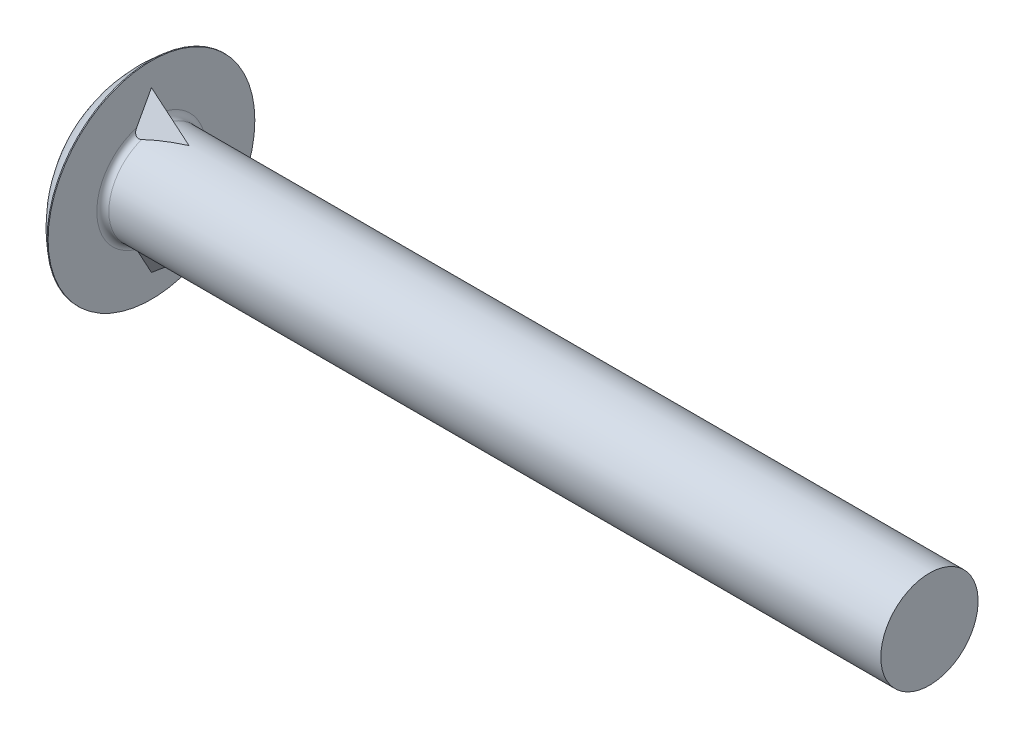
ISO-10303-21;
HEADER;
FILE_DESCRIPTION(('STEP AP214'),'2;1');
FILE_NAME('part.step','',(''),(''),'','','');
FILE_SCHEMA(('AUTOMOTIVE_DESIGN { 1 0 10303 214 1 1 1 1 }'));
ENDSEC;
DATA;
#1=APPLICATION_CONTEXT('core data for automotive mechanical design processes');
#2=APPLICATION_PROTOCOL_DEFINITION('international standard','automotive_design',2000,#1);
#3=PRODUCT_CONTEXT('',#1,'mechanical');
#4=PRODUCT('Part','Part','',(#3));
#5=PRODUCT_RELATED_PRODUCT_CATEGORY('part','',(#4));
#6=PRODUCT_DEFINITION_FORMATION('','',#4);
#7=PRODUCT_DEFINITION_CONTEXT('part definition',#1,'design');
#8=PRODUCT_DEFINITION('design','',#6,#7);
#9=PRODUCT_DEFINITION_SHAPE('','',#8);
#10=(LENGTH_UNIT() NAMED_UNIT(*) SI_UNIT(.MILLI.,.METRE.));
#11=(NAMED_UNIT(*) PLANE_ANGLE_UNIT() SI_UNIT($,.RADIAN.));
#12=(NAMED_UNIT(*) SI_UNIT($,.STERADIAN.) SOLID_ANGLE_UNIT());
#13=UNCERTAINTY_MEASURE_WITH_UNIT(LENGTH_MEASURE(1.E-05),#10,'distance_accuracy_value','');
#14=(GEOMETRIC_REPRESENTATION_CONTEXT(3) GLOBAL_UNCERTAINTY_ASSIGNED_CONTEXT((#13)) GLOBAL_UNIT_ASSIGNED_CONTEXT((#10,
#11,#12)) REPRESENTATION_CONTEXT('',''));
#15=CARTESIAN_POINT('',(0.,0.,0.));
#16=DIRECTION('',(0.,0.,1.));
#17=DIRECTION('',(1.,0.,0.));
#18=AXIS2_PLACEMENT_3D('',#15,#16,#17);
#19=CARTESIAN_POINT('',(0.,0.,0.));
#20=DIRECTION('',(-1.,0.,0.));
#21=DIRECTION('',(0.,0.,1.));
#22=AXIS2_PLACEMENT_3D('',#19,#20,#21);
#23=CYLINDRICAL_SURFACE('',#22,6.35);
#24=CARTESIAN_POINT('',(108.204,0.,0.));
#25=DIRECTION('',(-1.,0.,0.));
#26=DIRECTION('',(0.,0.,1.));
#27=AXIS2_PLACEMENT_3D('',#24,#25,#26);
#28=CIRCLE('',#27,6.35);
#29=CARTESIAN_POINT('',(108.204,0.,6.35));
#30=VERTEX_POINT('',#29);
#31=EDGE_CURVE('E162',#30,#30,#28,.T.);
#32=ORIENTED_EDGE('',*,*,#31,.T.);
#33=EDGE_LOOP('',(#32));
#34=FACE_BOUND('',#33,.T.);
#35=CARTESIAN_POINT('',(7.3914,0.,0.));
#36=DIRECTION('',(-1.,0.,0.));
#37=DIRECTION('',(0.,0.,1.));
#38=AXIS2_PLACEMENT_3D('',#35,#36,#37);
#39=CIRCLE('',#38,6.35);
#40=CARTESIAN_POINT('',(7.3914,-6.00637071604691,2.0605850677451));
#41=VERTEX_POINT('',#40);
#42=CARTESIAN_POINT('',(7.3914,6.0063707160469,2.06058506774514));
#43=VERTEX_POINT('',#42);
#44=EDGE_CURVE('E105',#41,#43,#39,.T.);
#45=ORIENTED_EDGE('',*,*,#44,.F.);
#46=CARTESIAN_POINT('',(19.0947448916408,0.,0.));
#47=DIRECTION('',(-0.371354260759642,0.443785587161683,-0.815567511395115));
#48=DIRECTION('',(-0.928491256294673,-0.177494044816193,0.326189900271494));
#49=AXIS2_PLACEMENT_3D('',#46,#47,#48);
#50=ELLIPSE('',#49,17.0995749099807,6.35);
#51=CARTESIAN_POINT('',(11.5062,-6.34999999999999,0.));
#52=VERTEX_POINT('',#51);
#53=EDGE_CURVE('E98',#41,#52,#50,.F.);
#54=ORIENTED_EDGE('',*,*,#53,.T.);
#55=CARTESIAN_POINT('',(19.0947448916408,0.,0.));
#56=DIRECTION('',(-0.371354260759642,0.443785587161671,0.815567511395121));
#57=DIRECTION('',(-0.928491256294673,-0.177494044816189,-0.326189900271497));
#58=AXIS2_PLACEMENT_3D('',#55,#56,#57);
#59=ELLIPSE('',#58,17.0995749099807,6.35);
#60=CARTESIAN_POINT('',(7.3914,-6.00637071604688,-2.06058506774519));
#61=VERTEX_POINT('',#60);
#62=EDGE_CURVE('E86',#52,#61,#59,.F.);
#63=ORIENTED_EDGE('',*,*,#62,.T.);
#64=CARTESIAN_POINT('',(7.3914,6.0063707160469,-2.06058506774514));
#65=VERTEX_POINT('',#64);
#66=EDGE_CURVE('E160',#65,#61,#39,.T.);
#67=ORIENTED_EDGE('',*,*,#66,.F.);
#68=CARTESIAN_POINT('',(19.0947448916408,0.,0.));
#69=DIRECTION('',(-0.371354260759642,-0.443785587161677,0.815567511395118));
#70=DIRECTION('',(-0.928491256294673,0.177494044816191,-0.326189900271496));
#71=AXIS2_PLACEMENT_3D('',#68,#69,#70);
#72=ELLIPSE('',#71,17.0995749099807,6.35);
#73=CARTESIAN_POINT('',(11.5062,6.34999999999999,0.));
#74=VERTEX_POINT('',#73);
#75=EDGE_CURVE('E147',#65,#74,#72,.F.);
#76=ORIENTED_EDGE('',*,*,#75,.T.);
#77=CARTESIAN_POINT('',(19.0947448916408,0.,0.));
#78=DIRECTION('',(-0.371354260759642,-0.443785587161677,-0.815567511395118));
#79=DIRECTION('',(-0.928491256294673,0.177494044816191,0.326189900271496));
#80=AXIS2_PLACEMENT_3D('',#77,#78,#79);
#81=ELLIPSE('',#80,17.0995749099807,6.35);
#82=EDGE_CURVE('E124',#74,#43,#81,.F.);
#83=ORIENTED_EDGE('',*,*,#82,.T.);
#84=EDGE_LOOP('',(#45,#54,#63,#67,#76,#83));
#85=FACE_BOUND('',#84,.T.);
#86=ADVANCED_FACE('F34',(#34,#85),#23,.T.);
#87=CARTESIAN_POINT('',(7.3914,0.,0.));
#88=DIRECTION('',(-1.,0.,0.));
#89=DIRECTION('',(0.,0.,1.));
#90=AXIS2_PLACEMENT_3D('',#87,#88,#89);
#91=TOROIDAL_SURFACE('',#90,7.1374,0.7874);
#92=CARTESIAN_POINT('',(7.3916,-6.00640916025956,2.06047308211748));
#93=CARTESIAN_POINT('',(7.36372668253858,-6.00103846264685,2.07608713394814));
#94=CARTESIAN_POINT('',(7.3350661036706,-5.99737529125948,2.09113051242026));
#95=CARTESIAN_POINT('',(7.27637319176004,-5.99418017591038,2.11959389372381));
#96=CARTESIAN_POINT('',(7.24632961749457,-5.99469200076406,2.1329951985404));
#97=CARTESIAN_POINT('',(7.1854538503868,-6.00072971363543,2.15742852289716));
#98=CARTESIAN_POINT('',(7.15461744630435,-6.00629297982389,2.16844212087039));
#99=CARTESIAN_POINT('',(7.09357934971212,-6.02295346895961,2.18716904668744));
#100=CARTESIAN_POINT('',(7.06337523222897,-6.03402249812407,2.19489882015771));
#101=CARTESIAN_POINT('',(7.00809759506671,-6.05995236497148,2.20595895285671));
#102=CARTESIAN_POINT('',(6.98283199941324,-6.07423608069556,2.20969080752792));
#103=CARTESIAN_POINT('',(6.93443573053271,-6.10647600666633,2.21418405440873));
#104=CARTESIAN_POINT('',(6.91130823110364,-6.12443755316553,2.21494109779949));
#105=CARTESIAN_POINT('',(6.86864109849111,-6.16239355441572,2.21371531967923));
#106=CARTESIAN_POINT('',(6.84899078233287,-6.18226922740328,2.21184753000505));
#107=CARTESIAN_POINT('',(6.81226461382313,-6.2239376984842,2.20589652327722));
#108=CARTESIAN_POINT('',(6.7951888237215,-6.24573054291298,2.20181325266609));
#109=CARTESIAN_POINT('',(6.75403898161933,-6.30417841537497,2.1887460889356));
#110=CARTESIAN_POINT('',(6.73193069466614,-6.34189072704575,2.17829180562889));
#111=CARTESIAN_POINT('',(6.69355369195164,-6.4190852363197,2.15376122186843));
#112=CARTESIAN_POINT('',(6.67730231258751,-6.45857230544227,2.13967437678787));
#113=CARTESIAN_POINT('',(6.64361793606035,-6.55681832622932,2.10155204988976));
#114=CARTESIAN_POINT('',(6.62916403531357,-6.61598231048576,2.07593969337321));
#115=CARTESIAN_POINT('',(6.60974716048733,-6.73394025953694,2.02059479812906));
#116=CARTESIAN_POINT('',(6.60480315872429,-6.79273325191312,1.99085414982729));
#117=CARTESIAN_POINT('',(6.6034817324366,-6.90020760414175,1.93297439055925));
#118=CARTESIAN_POINT('',(6.60595018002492,-6.94910322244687,1.9052442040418));
#119=CARTESIAN_POINT('',(6.61663481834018,-7.04488403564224,1.84826065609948));
#120=CARTESIAN_POINT('',(6.62480978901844,-7.091781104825,1.81901960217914));
#121=CARTESIAN_POINT('',(6.63565687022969,-7.1376,1.7891485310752));
#122=B_SPLINE_CURVE_WITH_KNOTS('',3,(#92,#93,#94,#95,#96,#97,#98,#99,#100,#101,#102,#103,#104,
#105,#106,#107,#108,#109,#110,#111,#112,#113,#114,#115,#116,#117,#118,#119,#120,#121),
.UNSPECIFIED.,.F.,.F.,(4,2,2,2,2,2,2,2,2,2,2,2,2,2,4),(0.,0.0973157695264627,0.195653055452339,
0.294723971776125,0.393292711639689,0.480608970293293,0.568052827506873,0.65178179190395,
0.735512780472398,0.869590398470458,1.00406168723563,1.20120281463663,1.3987368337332,
1.56718680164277,1.73443242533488),.UNSPECIFIED.);
#123=CARTESIAN_POINT('',(6.604,-6.86537516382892,1.95169224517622));
#124=VERTEX_POINT('',#123);
#125=EDGE_CURVE('E94',#41,#124,#122,.T.);
#126=ORIENTED_EDGE('',*,*,#125,.F.);
#127=ORIENTED_EDGE('',*,*,#44,.T.);
#128=CARTESIAN_POINT('',(6.63565687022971,7.1376,1.78914853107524));
#129=CARTESIAN_POINT('',(6.62756575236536,7.10347197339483,1.81140321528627));
#130=CARTESIAN_POINT('',(6.62097048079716,7.06874756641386,1.83330130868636));
#131=CARTESIAN_POINT('',(6.61089030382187,6.99825561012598,1.87624886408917));
#132=CARTESIAN_POINT('',(6.60741067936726,6.96248639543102,1.89729682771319));
#133=CARTESIAN_POINT('',(6.60368804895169,6.88976758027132,1.93856131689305));
#134=CARTESIAN_POINT('',(6.60348161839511,6.85280925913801,1.95876593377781));
#135=CARTESIAN_POINT('',(6.60660270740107,6.77837845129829,1.99784582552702));
#136=CARTESIAN_POINT('',(6.60992731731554,6.74090641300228,2.01672218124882));
#137=CARTESIAN_POINT('',(6.62183800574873,6.65522176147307,2.05792358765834));
#138=CARTESIAN_POINT('',(6.63163148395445,6.60692415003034,2.07974512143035));
#139=CARTESIAN_POINT('',(6.65822425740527,6.51091278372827,2.11988051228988));
#140=CARTESIAN_POINT('',(6.67499908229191,6.46319758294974,2.13820629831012));
#141=CARTESIAN_POINT('',(6.71090031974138,6.38257070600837,2.16573187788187));
#142=CARTESIAN_POINT('',(6.72811144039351,6.34919653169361,2.17605543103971));
#143=CARTESIAN_POINT('',(6.76724047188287,6.28439640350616,2.19349927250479));
#144=CARTESIAN_POINT('',(6.78915208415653,6.2529679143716,2.20062380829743));
#145=CARTESIAN_POINT('',(6.83250691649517,6.20006860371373,2.20966775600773));
#146=CARTESIAN_POINT('',(6.85297009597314,6.17793788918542,2.21239248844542));
#147=CARTESIAN_POINT('',(6.89679144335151,6.13654715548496,2.21496170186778));
#148=CARTESIAN_POINT('',(6.9201470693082,6.11728464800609,2.21480869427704));
#149=CARTESIAN_POINT('',(6.96948106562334,6.08240020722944,2.21132746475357));
#150=CARTESIAN_POINT('',(6.9954757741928,6.06680321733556,2.20797823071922));
#151=CARTESIAN_POINT('',(7.04910342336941,6.04012179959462,2.19807834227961));
#152=CARTESIAN_POINT('',(7.07673546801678,6.02903492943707,2.19152942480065));
#153=CARTESIAN_POINT('',(7.12993706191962,6.01240908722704,2.17635185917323));
#154=CARTESIAN_POINT('',(7.15544993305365,6.00643967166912,2.16798324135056));
#155=CARTESIAN_POINT('',(7.20639602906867,5.99813645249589,2.14930397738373));
#156=CARTESIAN_POINT('',(7.23182899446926,5.99580990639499,2.13898950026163));
#157=CARTESIAN_POINT('',(7.28010434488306,5.9944757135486,2.11773416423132));
#158=CARTESIAN_POINT('',(7.30299268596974,5.99522045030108,2.10690711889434));
#159=CARTESIAN_POINT('',(7.34793115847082,5.99911561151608,2.08432565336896));
#160=CARTESIAN_POINT('',(7.36998550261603,6.00225154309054,2.07257720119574));
#161=CARTESIAN_POINT('',(7.3916,6.00640916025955,2.06047308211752));
#162=B_SPLINE_CURVE_WITH_KNOTS('',3,(#128,#129,#130,#131,#132,#133,#134,#135,#136,#137,#138,
#139,#140,#141,#142,#143,#144,#145,#146,#147,#148,#149,#150,#151,#152,#153,#154,#155,#156,#157,
#158,#159,#160,#161),.UNSPECIFIED.,.F.,.F.,(4,2,2,2,2,2,2,2,2,2,2,2,2,2,2,2,4),(0.,
0.12459416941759,0.249399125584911,0.375597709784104,0.501692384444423,0.662902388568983,
0.823552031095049,0.940022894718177,1.05633865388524,1.14678047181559,1.23714336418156,
1.32810442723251,1.41901616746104,1.50119979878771,1.58354695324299,1.65939026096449,
1.73477750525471),.UNSPECIFIED.);
#163=CARTESIAN_POINT('',(6.604,6.86537516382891,1.95169224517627));
#164=VERTEX_POINT('',#163);
#165=EDGE_CURVE('E117',#164,#43,#162,.T.);
#166=ORIENTED_EDGE('',*,*,#165,.F.);
#167=CARTESIAN_POINT('',(6.604,0.,0.));
#168=DIRECTION('',(-1.,0.,0.));
#169=DIRECTION('',(0.,0.,1.));
#170=AXIS2_PLACEMENT_3D('',#167,#168,#169);
#171=CIRCLE('',#170,7.1374);
#172=EDGE_CURVE('E156',#124,#164,#171,.T.);
#173=ORIENTED_EDGE('',*,*,#172,.F.);
#174=EDGE_LOOP('',(#126,#127,#166,#173));
#175=FACE_BOUND('',#174,.T.);
#176=ADVANCED_FACE('F126',(#175),#91,.F.);
#177=CARTESIAN_POINT('',(6.63565687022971,-7.1376,-1.78914853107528));
#178=CARTESIAN_POINT('',(6.62756575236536,-7.10347197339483,-1.81140321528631));
#179=CARTESIAN_POINT('',(6.62097048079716,-7.06874756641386,-1.8333013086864));
#180=CARTESIAN_POINT('',(6.61089030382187,-6.99825561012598,-1.87624886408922));
#181=CARTESIAN_POINT('',(6.60741067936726,-6.96248639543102,-1.89729682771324));
#182=CARTESIAN_POINT('',(6.60368804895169,-6.88976758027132,-1.93856131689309));
#183=CARTESIAN_POINT('',(6.60348161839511,-6.852809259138,-1.95876593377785));
#184=CARTESIAN_POINT('',(6.60660270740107,-6.77837845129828,-1.99784582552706));
#185=CARTESIAN_POINT('',(6.60992731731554,-6.74090641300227,-2.01672218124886));
#186=CARTESIAN_POINT('',(6.62183800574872,-6.65522176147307,-2.05792358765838));
#187=CARTESIAN_POINT('',(6.63163148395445,-6.60692415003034,-2.07974512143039));
#188=CARTESIAN_POINT('',(6.65822425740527,-6.51091278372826,-2.11988051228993));
#189=CARTESIAN_POINT('',(6.67499908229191,-6.46319758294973,-2.13820629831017));
#190=CARTESIAN_POINT('',(6.71090031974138,-6.38257070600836,-2.16573187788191));
#191=CARTESIAN_POINT('',(6.72811144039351,-6.3491965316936,-2.17605543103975));
#192=CARTESIAN_POINT('',(6.76724047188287,-6.28439640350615,-2.19349927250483));
#193=CARTESIAN_POINT('',(6.78915208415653,-6.25296791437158,-2.20062380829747));
#194=CARTESIAN_POINT('',(6.83250691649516,-6.20006860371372,-2.20966775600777));
#195=CARTESIAN_POINT('',(6.85297009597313,-6.17793788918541,-2.21239248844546));
#196=CARTESIAN_POINT('',(6.89679144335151,-6.13654715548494,-2.21496170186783));
#197=CARTESIAN_POINT('',(6.92014706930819,-6.11728464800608,-2.21480869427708));
#198=CARTESIAN_POINT('',(6.96948106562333,-6.08240020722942,-2.21132746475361));
#199=CARTESIAN_POINT('',(6.9954757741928,-6.06680321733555,-2.20797823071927));
#200=CARTESIAN_POINT('',(7.0491034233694,-6.0401217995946,-2.19807834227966));
#201=CARTESIAN_POINT('',(7.07673546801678,-6.02903492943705,-2.19152942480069));
#202=CARTESIAN_POINT('',(7.12993706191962,-6.01240908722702,-2.17635185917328));
#203=CARTESIAN_POINT('',(7.15544993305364,-6.0064396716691,-2.16798324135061));
#204=CARTESIAN_POINT('',(7.20639602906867,-5.99813645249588,-2.14930397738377));
#205=CARTESIAN_POINT('',(7.23182899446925,-5.99580990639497,-2.13898950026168));
#206=CARTESIAN_POINT('',(7.28010434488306,-5.99447571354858,-2.11773416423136));
#207=CARTESIAN_POINT('',(7.30299268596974,-5.99522045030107,-2.10690711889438));
#208=CARTESIAN_POINT('',(7.34793115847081,-5.99911561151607,-2.084325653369));
#209=CARTESIAN_POINT('',(7.36998550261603,-6.00225154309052,-2.07257720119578));
#210=CARTESIAN_POINT('',(7.3916,-6.00640916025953,-2.06047308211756));
#211=B_SPLINE_CURVE_WITH_KNOTS('',3,(#177,#178,#179,#180,#181,#182,#183,#184,#185,#186,#187,
#188,#189,#190,#191,#192,#193,#194,#195,#196,#197,#198,#199,#200,#201,#202,#203,#204,#205,#206,
#207,#208,#209,#210),.UNSPECIFIED.,.F.,.F.,(4,2,2,2,2,2,2,2,2,2,2,2,2,2,2,2,4),(0.,
0.124594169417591,0.249399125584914,0.375597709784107,0.501692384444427,0.66290238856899,
0.823552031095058,0.940022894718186,1.05633865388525,1.1467804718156,1.23714336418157,
1.32810442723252,1.41901616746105,1.50119979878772,1.583546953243,1.6593902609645,
1.73477750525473),.UNSPECIFIED.);
#212=CARTESIAN_POINT('',(6.604,-6.8653751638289,-1.95169224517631));
#213=VERTEX_POINT('',#212);
#214=EDGE_CURVE('E89',#213,#61,#211,.T.);
#215=ORIENTED_EDGE('',*,*,#214,.F.);
#216=CARTESIAN_POINT('',(6.604,6.86537516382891,-1.95169224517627));
#217=VERTEX_POINT('',#216);
#218=EDGE_CURVE('E157',#217,#213,#171,.T.);
#219=ORIENTED_EDGE('',*,*,#218,.F.);
#220=CARTESIAN_POINT('',(7.3916,6.00640916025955,-2.06047308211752));
#221=CARTESIAN_POINT('',(7.36372668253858,6.00103846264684,-2.07608713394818));
#222=CARTESIAN_POINT('',(7.3350661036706,5.99737529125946,-2.0911305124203));
#223=CARTESIAN_POINT('',(7.27637319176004,5.99418017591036,-2.11959389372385));
#224=CARTESIAN_POINT('',(7.24632961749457,5.99469200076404,-2.13299519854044));
#225=CARTESIAN_POINT('',(7.18545385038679,6.00072971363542,-2.1574285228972));
#226=CARTESIAN_POINT('',(7.15461744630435,6.00629297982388,-2.16844212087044));
#227=CARTESIAN_POINT('',(7.09357934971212,6.02295346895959,-2.18716904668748));
#228=CARTESIAN_POINT('',(7.06337523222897,6.03402249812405,-2.19489882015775));
#229=CARTESIAN_POINT('',(7.00809759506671,6.05995236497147,-2.20595895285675));
#230=CARTESIAN_POINT('',(6.98283199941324,6.07423608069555,-2.20969080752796));
#231=CARTESIAN_POINT('',(6.93443573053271,6.10647600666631,-2.21418405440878));
#232=CARTESIAN_POINT('',(6.91130823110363,6.12443755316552,-2.21494109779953));
#233=CARTESIAN_POINT('',(6.86864109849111,6.1623935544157,-2.21371531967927));
#234=CARTESIAN_POINT('',(6.84899078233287,6.18226922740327,-2.21184753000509));
#235=CARTESIAN_POINT('',(6.81226461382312,6.22393769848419,-2.20589652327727));
#236=CARTESIAN_POINT('',(6.79518882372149,6.24573054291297,-2.20181325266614));
#237=CARTESIAN_POINT('',(6.75403898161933,6.30417841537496,-2.18874608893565));
#238=CARTESIAN_POINT('',(6.73193069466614,6.34189072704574,-2.17829180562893));
#239=CARTESIAN_POINT('',(6.69355369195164,6.41908523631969,-2.15376122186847));
#240=CARTESIAN_POINT('',(6.67730231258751,6.45857230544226,-2.13967437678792));
#241=CARTESIAN_POINT('',(6.64361793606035,6.5568183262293,-2.1015520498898));
#242=CARTESIAN_POINT('',(6.62916403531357,6.61598231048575,-2.07593969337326));
#243=CARTESIAN_POINT('',(6.60974716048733,6.73394025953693,-2.0205947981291));
#244=CARTESIAN_POINT('',(6.60480315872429,6.79273325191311,-1.99085414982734));
#245=CARTESIAN_POINT('',(6.6034817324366,6.90020760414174,-1.93297439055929));
#246=CARTESIAN_POINT('',(6.60595018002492,6.94910322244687,-1.90524420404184));
#247=CARTESIAN_POINT('',(6.61663481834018,7.04488403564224,-1.84826065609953));
#248=CARTESIAN_POINT('',(6.62480978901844,7.091781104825,-1.81901960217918));
#249=CARTESIAN_POINT('',(6.63565687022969,7.1376,-1.78914853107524));
#250=B_SPLINE_CURVE_WITH_KNOTS('',3,(#220,#221,#222,#223,#224,#225,#226,#227,#228,#229,#230,
#231,#232,#233,#234,#235,#236,#237,#238,#239,#240,#241,#242,#243,#244,#245,#246,#247,#248,#249),
.UNSPECIFIED.,.F.,.F.,(4,2,2,2,2,2,2,2,2,2,2,2,2,2,4),(0.,0.0973157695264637,0.19565305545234,
0.294723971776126,0.393292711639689,0.480608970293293,0.568052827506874,0.651781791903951,
0.735512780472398,0.869590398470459,1.00406168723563,1.20120281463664,1.3987368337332,
1.56718680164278,1.73443242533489),.UNSPECIFIED.);
#251=EDGE_CURVE('E142',#65,#217,#250,.T.);
#252=ORIENTED_EDGE('',*,*,#251,.F.);
#253=ORIENTED_EDGE('',*,*,#66,.T.);
#254=EDGE_LOOP('',(#215,#219,#252,#253));
#255=FACE_BOUND('',#254,.T.);
#256=ADVANCED_FACE('F171',(#255),#91,.F.);
#257=CARTESIAN_POINT('',(6.604,13.5001,0.));
#258=DIRECTION('',(1.,0.,0.));
#259=DIRECTION('',(0.,0.,-1.));
#260=AXIS2_PLACEMENT_3D('',#257,#258,#259);
#261=PLANE('',#260);
#262=CARTESIAN_POINT('',(6.604,0.,0.));
#263=DIRECTION('',(-1.,0.,0.));
#264=DIRECTION('',(0.,0.,1.));
#265=AXIS2_PLACEMENT_3D('',#262,#263,#264);
#266=CIRCLE('',#265,13.5001);
#267=CARTESIAN_POINT('',(6.604,0.,13.5001));
#268=VERTEX_POINT('',#267);
#269=EDGE_CURVE('E153',#268,#268,#266,.T.);
#270=ORIENTED_EDGE('',*,*,#269,.F.);
#271=EDGE_LOOP('',(#270));
#272=FACE_BOUND('',#271,.T.);
#273=DIRECTION('',(0.,0.878379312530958,-0.477964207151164));
#274=VECTOR('',#273,1.);
#275=CARTESIAN_POINT('',(6.604,-10.4521,0.));
#276=LINE('',#275,#274);
#277=CARTESIAN_POINT('',(6.604,-10.4521,0.));
#278=VERTEX_POINT('',#277);
#279=EDGE_CURVE('E101',#278,#213,#276,.T.);
#280=ORIENTED_EDGE('',*,*,#279,.F.);
#281=DIRECTION('',(0.,0.878379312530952,0.477964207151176));
#282=VECTOR('',#281,1.);
#283=CARTESIAN_POINT('',(6.604,8.02822510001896,10.0559448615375));
#284=LINE('',#283,#282);
#285=EDGE_CURVE('E12',#278,#124,#284,.T.);
#286=ORIENTED_EDGE('',*,*,#285,.T.);
#287=ORIENTED_EDGE('',*,*,#172,.T.);
#288=DIRECTION('',(0.,-0.878379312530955,0.47796420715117));
#289=VECTOR('',#288,1.);
#290=CARTESIAN_POINT('',(6.604,10.4521,0.));
#291=LINE('',#290,#289);
#292=CARTESIAN_POINT('',(6.604,10.4521,0.));
#293=VERTEX_POINT('',#292);
#294=EDGE_CURVE('E106',#293,#164,#291,.T.);
#295=ORIENTED_EDGE('',*,*,#294,.F.);
#296=DIRECTION('',(0.,-0.878379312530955,-0.47796420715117));
#297=VECTOR('',#296,1.);
#298=CARTESIAN_POINT('',(6.604,12.8037850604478,1.27965364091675));
#299=LINE('',#298,#297);
#300=EDGE_CURVE('E42',#293,#217,#299,.T.);
#301=ORIENTED_EDGE('',*,*,#300,.T.);
#302=ORIENTED_EDGE('',*,*,#218,.T.);
#303=EDGE_LOOP('',(#280,#286,#287,#295,#301,#302));
#304=FACE_BOUND('',#303,.T.);
#305=ADVANCED_FACE('F168',(#272,#304),#261,.T.);
#306=CARTESIAN_POINT('',(17.3077218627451,0.,0.));
#307=DIRECTION('',(-1.,0.,0.));
#308=DIRECTION('',(0.,1.,0.));
#309=AXIS2_PLACEMENT_3D('',#306,#307,#308);
#310=SPHERICAL_SURFACE('',#309,17.3077218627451);
#311=CARTESIAN_POINT('',(6.477,0.,0.));
#312=DIRECTION('',(-1.,0.,0.));
#313=DIRECTION('',(0.,0.,1.));
#314=AXIS2_PLACEMENT_3D('',#311,#312,#313);
#315=CIRCLE('',#314,13.5001);
#316=CARTESIAN_POINT('',(6.477,0.,13.5001));
#317=VERTEX_POINT('',#316);
#318=EDGE_CURVE('E150',#317,#317,#315,.T.);
#319=ORIENTED_EDGE('',*,*,#318,.T.);
#320=EDGE_LOOP('',(#319));
#321=FACE_BOUND('',#320,.T.);
#322=ADVANCED_FACE('F36',(#321),#310,.T.);
#323=CARTESIAN_POINT('',(108.204,6.35,0.));
#324=DIRECTION('',(1.,0.,0.));
#325=DIRECTION('',(0.,0.,-1.));
#326=AXIS2_PLACEMENT_3D('',#323,#324,#325);
#327=PLANE('',#326);
#328=ORIENTED_EDGE('',*,*,#31,.F.);
#329=EDGE_LOOP('',(#328));
#330=FACE_BOUND('',#329,.T.);
#331=ADVANCED_FACE('F188',(#330),#327,.T.);
#332=CARTESIAN_POINT('',(0.,0.,0.));
#333=DIRECTION('',(-1.,0.,0.));
#334=DIRECTION('',(0.,0.,1.));
#335=AXIS2_PLACEMENT_3D('',#332,#333,#334);
#336=CYLINDRICAL_SURFACE('',#335,13.5001);
#337=ORIENTED_EDGE('',*,*,#318,.F.);
#338=EDGE_LOOP('',(#337));
#339=FACE_BOUND('',#338,.T.);
#340=ORIENTED_EDGE('',*,*,#269,.T.);
#341=EDGE_LOOP('',(#340));
#342=FACE_BOUND('',#341,.T.);
#343=ADVANCED_FACE('F140',(#339,#342),#336,.T.);
#344=CARTESIAN_POINT('',(11.5062,1.72879074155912,-2.5146));
#345=DIRECTION('',(-0.371354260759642,-0.443785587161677,0.815567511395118));
#346=DIRECTION('',(0.,-0.878379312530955,-0.47796420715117));
#347=AXIS2_PLACEMENT_3D('',#344,#345,#346);
#348=PLANE('',#347);
#349=ORIENTED_EDGE('',*,*,#75,.F.);
#350=ORIENTED_EDGE('',*,*,#251,.T.);
#351=ORIENTED_EDGE('',*,*,#300,.F.);
#352=DIRECTION('',(-0.766916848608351,0.641746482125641,0.));
#353=VECTOR('',#352,1.);
#354=CARTESIAN_POINT('',(11.5062,6.34999999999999,0.));
#355=LINE('',#354,#353);
#356=EDGE_CURVE('E57',#74,#293,#355,.T.);
#357=ORIENTED_EDGE('',*,*,#356,.F.);
#358=EDGE_LOOP('',(#349,#350,#351,#357));
#359=FACE_BOUND('',#358,.T.);
#360=ADVANCED_FACE('F134',(#359),#348,.F.);
#361=CARTESIAN_POINT('',(11.5062,6.34999999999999,0.));
#362=DIRECTION('',(-0.371354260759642,-0.443785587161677,-0.815567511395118));
#363=DIRECTION('',(0.,0.878379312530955,-0.47796420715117));
#364=AXIS2_PLACEMENT_3D('',#361,#362,#363);
#365=PLANE('',#364);
#366=ORIENTED_EDGE('',*,*,#82,.F.);
#367=ORIENTED_EDGE('',*,*,#356,.T.);
#368=ORIENTED_EDGE('',*,*,#294,.T.);
#369=ORIENTED_EDGE('',*,*,#165,.T.);
#370=EDGE_LOOP('',(#366,#367,#368,#369));
#371=FACE_BOUND('',#370,.T.);
#372=ADVANCED_FACE('F130',(#371),#365,.F.);
#373=CARTESIAN_POINT('',(11.5062,-1.72879074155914,2.51459999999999));
#374=DIRECTION('',(-0.371354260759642,0.443785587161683,-0.815567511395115));
#375=DIRECTION('',(0.,0.878379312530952,0.477964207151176));
#376=AXIS2_PLACEMENT_3D('',#373,#374,#375);
#377=PLANE('',#376);
#378=ORIENTED_EDGE('',*,*,#53,.F.);
#379=ORIENTED_EDGE('',*,*,#125,.T.);
#380=ORIENTED_EDGE('',*,*,#285,.F.);
#381=DIRECTION('',(-0.766916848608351,-0.641746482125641,0.));
#382=VECTOR('',#381,1.);
#383=CARTESIAN_POINT('',(11.5062,-6.34999999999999,0.));
#384=LINE('',#383,#382);
#385=EDGE_CURVE('E49',#52,#278,#384,.T.);
#386=ORIENTED_EDGE('',*,*,#385,.F.);
#387=EDGE_LOOP('',(#378,#379,#380,#386));
#388=FACE_BOUND('',#387,.T.);
#389=ADVANCED_FACE('F97',(#388),#377,.F.);
#390=CARTESIAN_POINT('',(11.5062,-6.34999999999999,0.));
#391=DIRECTION('',(-0.371354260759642,0.443785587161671,0.815567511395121));
#392=DIRECTION('',(0.,-0.878379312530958,0.477964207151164));
#393=AXIS2_PLACEMENT_3D('',#390,#391,#392);
#394=PLANE('',#393);
#395=ORIENTED_EDGE('',*,*,#62,.F.);
#396=ORIENTED_EDGE('',*,*,#385,.T.);
#397=ORIENTED_EDGE('',*,*,#279,.T.);
#398=ORIENTED_EDGE('',*,*,#214,.T.);
#399=EDGE_LOOP('',(#395,#396,#397,#398));
#400=FACE_BOUND('',#399,.T.);
#401=ADVANCED_FACE('F87',(#400),#394,.F.);
#402=CLOSED_SHELL('',(#86,#176,#256,#305,#322,#331,#343,#360,#372,#389,#401));
#403=MANIFOLD_SOLID_BREP('B2',#402);
#404=ADVANCED_BREP_SHAPE_REPRESENTATION('',(#18,#403),#14);
#405=SHAPE_DEFINITION_REPRESENTATION(#9,#404);
ENDSEC;
END-ISO-10303-21;
